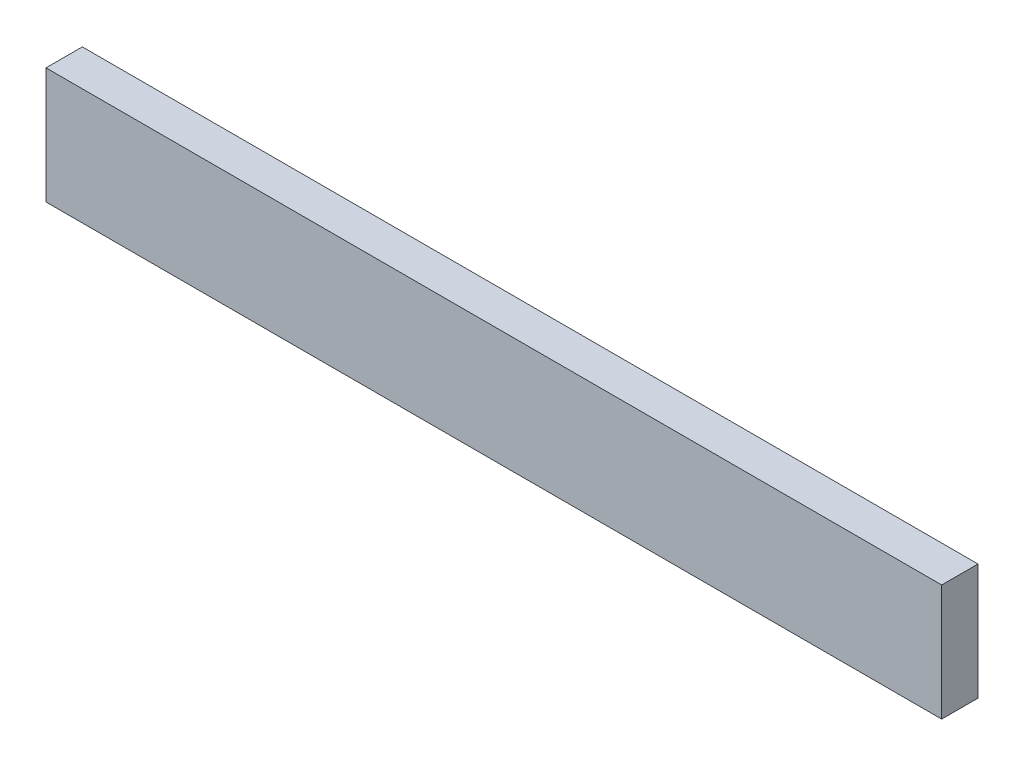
ISO-10303-21;
HEADER;
FILE_DESCRIPTION(('STEP AP214'),'2;1');
FILE_NAME('part.step','',(''),(''),'','','');
FILE_SCHEMA(('AUTOMOTIVE_DESIGN { 1 0 10303 214 1 1 1 1 }'));
ENDSEC;
DATA;
#1=APPLICATION_CONTEXT('core data for automotive mechanical design processes');
#2=APPLICATION_PROTOCOL_DEFINITION('international standard','automotive_design',2000,#1);
#3=PRODUCT_CONTEXT('',#1,'mechanical');
#4=PRODUCT('Part','Part','',(#3));
#5=PRODUCT_RELATED_PRODUCT_CATEGORY('part','',(#4));
#6=PRODUCT_DEFINITION_FORMATION('','',#4);
#7=PRODUCT_DEFINITION_CONTEXT('part definition',#1,'design');
#8=PRODUCT_DEFINITION('design','',#6,#7);
#9=PRODUCT_DEFINITION_SHAPE('','',#8);
#10=(LENGTH_UNIT() NAMED_UNIT(*) SI_UNIT(.MILLI.,.METRE.));
#11=(NAMED_UNIT(*) PLANE_ANGLE_UNIT() SI_UNIT($,.RADIAN.));
#12=(NAMED_UNIT(*) SI_UNIT($,.STERADIAN.) SOLID_ANGLE_UNIT());
#13=UNCERTAINTY_MEASURE_WITH_UNIT(LENGTH_MEASURE(1.E-05),#10,'distance_accuracy_value','');
#14=(GEOMETRIC_REPRESENTATION_CONTEXT(3) GLOBAL_UNCERTAINTY_ASSIGNED_CONTEXT((#13)) GLOBAL_UNIT_ASSIGNED_CONTEXT((#10,
#11,#12)) REPRESENTATION_CONTEXT('',''));
#15=CARTESIAN_POINT('',(0.,0.,0.));
#16=DIRECTION('',(0.,0.,1.));
#17=DIRECTION('',(1.,0.,0.));
#18=AXIS2_PLACEMENT_3D('',#15,#16,#17);
#19=CARTESIAN_POINT('',(0.,0.,15.));
#20=DIRECTION('',(1.,0.,0.));
#21=DIRECTION('',(0.,0.,-1.));
#22=AXIS2_PLACEMENT_3D('',#19,#20,#21);
#23=PLANE('',#22);
#24=DIRECTION('',(0.,-1.,0.));
#25=VECTOR('',#24,1.);
#26=CARTESIAN_POINT('',(0.,0.,0.));
#27=LINE('',#26,#25);
#28=CARTESIAN_POINT('',(0.,48.,0.));
#29=VERTEX_POINT('',#28);
#30=CARTESIAN_POINT('',(0.,0.,0.));
#31=VERTEX_POINT('',#30);
#32=EDGE_CURVE('E102',#29,#31,#27,.T.);
#33=ORIENTED_EDGE('',*,*,#32,.T.);
#34=DIRECTION('',(0.,0.,-1.));
#35=VECTOR('',#34,1.);
#36=CARTESIAN_POINT('',(0.,0.,15.));
#37=LINE('',#36,#35);
#38=CARTESIAN_POINT('',(0.,0.,15.));
#39=VERTEX_POINT('',#38);
#40=EDGE_CURVE('E11',#39,#31,#37,.T.);
#41=ORIENTED_EDGE('',*,*,#40,.F.);
#42=DIRECTION('',(0.,-1.,0.));
#43=VECTOR('',#42,1.);
#44=CARTESIAN_POINT('',(0.,0.,15.));
#45=LINE('',#44,#43);
#46=CARTESIAN_POINT('',(0.,48.,15.));
#47=VERTEX_POINT('',#46);
#48=EDGE_CURVE('E90',#47,#39,#45,.T.);
#49=ORIENTED_EDGE('',*,*,#48,.F.);
#50=DIRECTION('',(0.,0.,-1.));
#51=VECTOR('',#50,1.);
#52=CARTESIAN_POINT('',(0.,48.,15.));
#53=LINE('',#52,#51);
#54=EDGE_CURVE('E98',#47,#29,#53,.T.);
#55=ORIENTED_EDGE('',*,*,#54,.T.);
#56=EDGE_LOOP('',(#33,#41,#49,#55));
#57=FACE_BOUND('',#56,.T.);
#58=ADVANCED_FACE('F39',(#57),#23,.F.);
#59=CARTESIAN_POINT('',(0.,0.,15.));
#60=DIRECTION('',(0.,1.,0.));
#61=DIRECTION('',(0.,0.,1.));
#62=AXIS2_PLACEMENT_3D('',#59,#60,#61);
#63=PLANE('',#62);
#64=DIRECTION('',(1.,0.,0.));
#65=VECTOR('',#64,1.);
#66=CARTESIAN_POINT('',(0.,0.,0.));
#67=LINE('',#66,#65);
#68=CARTESIAN_POINT('',(370.,0.,0.));
#69=VERTEX_POINT('',#68);
#70=EDGE_CURVE('E94',#31,#69,#67,.T.);
#71=ORIENTED_EDGE('',*,*,#70,.T.);
#72=DIRECTION('',(0.,0.,-1.));
#73=VECTOR('',#72,1.);
#74=CARTESIAN_POINT('',(370.,0.,15.));
#75=LINE('',#74,#73);
#76=CARTESIAN_POINT('',(370.,0.,15.));
#77=VERTEX_POINT('',#76);
#78=EDGE_CURVE('E47',#77,#69,#75,.T.);
#79=ORIENTED_EDGE('',*,*,#78,.F.);
#80=DIRECTION('',(1.,0.,0.));
#81=VECTOR('',#80,1.);
#82=CARTESIAN_POINT('',(0.,0.,15.));
#83=LINE('',#82,#81);
#84=EDGE_CURVE('E85',#39,#77,#83,.T.);
#85=ORIENTED_EDGE('',*,*,#84,.F.);
#86=ORIENTED_EDGE('',*,*,#40,.T.);
#87=EDGE_LOOP('',(#71,#79,#85,#86));
#88=FACE_BOUND('',#87,.T.);
#89=ADVANCED_FACE('F93',(#88),#63,.F.);
#90=CARTESIAN_POINT('',(370.,0.,15.));
#91=DIRECTION('',(-1.,0.,0.));
#92=DIRECTION('',(0.,0.,1.));
#93=AXIS2_PLACEMENT_3D('',#90,#91,#92);
#94=PLANE('',#93);
#95=DIRECTION('',(0.,1.,0.));
#96=VECTOR('',#95,1.);
#97=CARTESIAN_POINT('',(370.,0.,0.));
#98=LINE('',#97,#96);
#99=CARTESIAN_POINT('',(370.,48.,0.));
#100=VERTEX_POINT('',#99);
#101=EDGE_CURVE('E72',#69,#100,#98,.T.);
#102=ORIENTED_EDGE('',*,*,#101,.T.);
#103=DIRECTION('',(0.,0.,-1.));
#104=VECTOR('',#103,1.);
#105=CARTESIAN_POINT('',(370.,48.,15.));
#106=LINE('',#105,#104);
#107=CARTESIAN_POINT('',(370.,48.,15.));
#108=VERTEX_POINT('',#107);
#109=EDGE_CURVE('E95',#108,#100,#106,.T.);
#110=ORIENTED_EDGE('',*,*,#109,.F.);
#111=DIRECTION('',(0.,1.,0.));
#112=VECTOR('',#111,1.);
#113=CARTESIAN_POINT('',(370.,0.,15.));
#114=LINE('',#113,#112);
#115=EDGE_CURVE('E88',#77,#108,#114,.T.);
#116=ORIENTED_EDGE('',*,*,#115,.F.);
#117=ORIENTED_EDGE('',*,*,#78,.T.);
#118=EDGE_LOOP('',(#102,#110,#116,#117));
#119=FACE_BOUND('',#118,.T.);
#120=ADVANCED_FACE('F96',(#119),#94,.F.);
#121=CARTESIAN_POINT('',(0.,48.,15.));
#122=DIRECTION('',(0.,-1.,0.));
#123=DIRECTION('',(0.,0.,-1.));
#124=AXIS2_PLACEMENT_3D('',#121,#122,#123);
#125=PLANE('',#124);
#126=DIRECTION('',(-1.,0.,0.));
#127=VECTOR('',#126,1.);
#128=CARTESIAN_POINT('',(0.,48.,0.));
#129=LINE('',#128,#127);
#130=EDGE_CURVE('E78',#100,#29,#129,.T.);
#131=ORIENTED_EDGE('',*,*,#130,.T.);
#132=ORIENTED_EDGE('',*,*,#54,.F.);
#133=DIRECTION('',(-1.,0.,0.));
#134=VECTOR('',#133,1.);
#135=CARTESIAN_POINT('',(0.,48.,15.));
#136=LINE('',#135,#134);
#137=EDGE_CURVE('E55',#108,#47,#136,.T.);
#138=ORIENTED_EDGE('',*,*,#137,.F.);
#139=ORIENTED_EDGE('',*,*,#109,.T.);
#140=EDGE_LOOP('',(#131,#132,#138,#139));
#141=FACE_BOUND('',#140,.T.);
#142=ADVANCED_FACE('F109',(#141),#125,.F.);
#143=CARTESIAN_POINT('',(0.,48.,15.));
#144=DIRECTION('',(0.,0.,-1.));
#145=DIRECTION('',(-1.,0.,0.));
#146=AXIS2_PLACEMENT_3D('',#143,#144,#145);
#147=PLANE('',#146);
#148=ORIENTED_EDGE('',*,*,#48,.T.);
#149=ORIENTED_EDGE('',*,*,#84,.T.);
#150=ORIENTED_EDGE('',*,*,#115,.T.);
#151=ORIENTED_EDGE('',*,*,#137,.T.);
#152=EDGE_LOOP('',(#148,#149,#150,#151));
#153=FACE_BOUND('',#152,.T.);
#154=ADVANCED_FACE('F86',(#153),#147,.F.);
#155=CARTESIAN_POINT('',(0.,48.,0.));
#156=DIRECTION('',(0.,0.,-1.));
#157=DIRECTION('',(-1.,0.,0.));
#158=AXIS2_PLACEMENT_3D('',#155,#156,#157);
#159=PLANE('',#158);
#160=ORIENTED_EDGE('',*,*,#32,.F.);
#161=ORIENTED_EDGE('',*,*,#130,.F.);
#162=ORIENTED_EDGE('',*,*,#101,.F.);
#163=ORIENTED_EDGE('',*,*,#70,.F.);
#164=EDGE_LOOP('',(#160,#161,#162,#163));
#165=FACE_BOUND('',#164,.T.);
#166=ADVANCED_FACE('F112',(#165),#159,.T.);
#167=CLOSED_SHELL('',(#58,#89,#120,#142,#154,#166));
#168=MANIFOLD_SOLID_BREP('B2',#167);
#169=ADVANCED_BREP_SHAPE_REPRESENTATION('',(#18,#168),#14);
#170=SHAPE_DEFINITION_REPRESENTATION(#9,#169);
ENDSEC;
END-ISO-10303-21;
